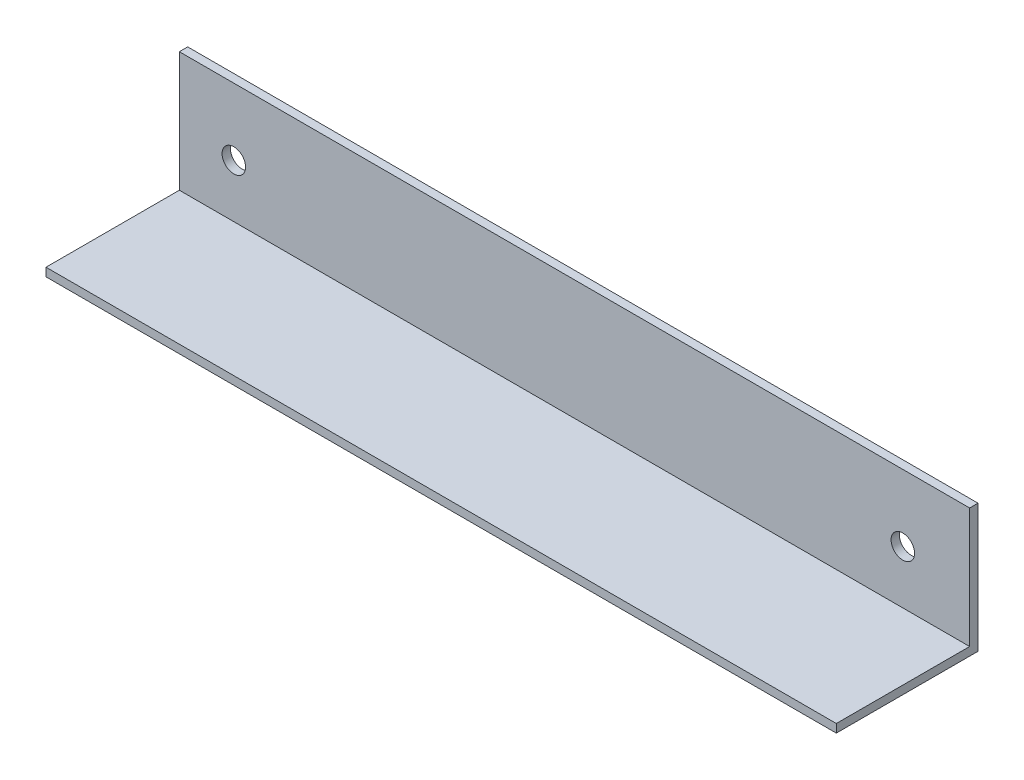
ISO-10303-21;
HEADER;
FILE_DESCRIPTION(('STEP AP214'),'2;1');
FILE_NAME('part.step','',(''),(''),'','','');
FILE_SCHEMA(('AUTOMOTIVE_DESIGN { 1 0 10303 214 1 1 1 1 }'));
ENDSEC;
DATA;
#1=APPLICATION_CONTEXT('core data for automotive mechanical design processes');
#2=APPLICATION_PROTOCOL_DEFINITION('international standard','automotive_design',2000,#1);
#3=PRODUCT_CONTEXT('',#1,'mechanical');
#4=PRODUCT('Part','Part','',(#3));
#5=PRODUCT_RELATED_PRODUCT_CATEGORY('part','',(#4));
#6=PRODUCT_DEFINITION_FORMATION('','',#4);
#7=PRODUCT_DEFINITION_CONTEXT('part definition',#1,'design');
#8=PRODUCT_DEFINITION('design','',#6,#7);
#9=PRODUCT_DEFINITION_SHAPE('','',#8);
#10=(LENGTH_UNIT() NAMED_UNIT(*) SI_UNIT(.MILLI.,.METRE.));
#11=(NAMED_UNIT(*) PLANE_ANGLE_UNIT() SI_UNIT($,.RADIAN.));
#12=(NAMED_UNIT(*) SI_UNIT($,.STERADIAN.) SOLID_ANGLE_UNIT());
#13=UNCERTAINTY_MEASURE_WITH_UNIT(LENGTH_MEASURE(1.E-05),#10,'distance_accuracy_value','');
#14=(GEOMETRIC_REPRESENTATION_CONTEXT(3) GLOBAL_UNCERTAINTY_ASSIGNED_CONTEXT((#13)) GLOBAL_UNIT_ASSIGNED_CONTEXT((#10,
#11,#12)) REPRESENTATION_CONTEXT('',''));
#15=CARTESIAN_POINT('',(0.,0.,0.));
#16=DIRECTION('',(0.,0.,1.));
#17=DIRECTION('',(1.,0.,0.));
#18=AXIS2_PLACEMENT_3D('',#15,#16,#17);
#19=CARTESIAN_POINT('',(0.,0.,26.924));
#20=DIRECTION('',(0.,0.,1.));
#21=DIRECTION('',(1.,0.,0.));
#22=AXIS2_PLACEMENT_3D('',#19,#20,#21);
#23=PLANE('',#22);
#24=DIRECTION('',(0.,1.,0.));
#25=VECTOR('',#24,1.);
#26=CARTESIAN_POINT('',(46.4015973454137,0.,26.924));
#27=LINE('',#26,#25);
#28=CARTESIAN_POINT('',(46.4015973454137,43.4545093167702,26.924));
#29=VERTEX_POINT('',#28);
#30=CARTESIAN_POINT('',(46.4015973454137,45.0420093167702,26.924));
#31=VERTEX_POINT('',#30);
#32=EDGE_CURVE('E54',#29,#31,#27,.T.);
#33=ORIENTED_EDGE('',*,*,#32,.F.);
#34=DIRECTION('',(1.,0.,0.));
#35=VECTOR('',#34,1.);
#36=CARTESIAN_POINT('',(-209.826086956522,43.4545093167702,26.924));
#37=LINE('',#36,#35);
#38=CARTESIAN_POINT('',(196.573913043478,43.4545093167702,26.924));
#39=VERTEX_POINT('',#38);
#40=EDGE_CURVE('E61',#29,#39,#37,.T.);
#41=ORIENTED_EDGE('',*,*,#40,.T.);
#42=DIRECTION('',(0.,1.,0.));
#43=VECTOR('',#42,1.);
#44=CARTESIAN_POINT('',(196.573913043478,67.8385093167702,26.924));
#45=LINE('',#44,#43);
#46=CARTESIAN_POINT('',(196.573913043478,45.0420093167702,26.924));
#47=VERTEX_POINT('',#46);
#48=EDGE_CURVE('E127',#39,#47,#45,.T.);
#49=ORIENTED_EDGE('',*,*,#48,.T.);
#50=DIRECTION('',(1.,0.,0.));
#51=VECTOR('',#50,1.);
#52=CARTESIAN_POINT('',(-209.826086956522,45.0420093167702,26.924));
#53=LINE('',#52,#51);
#54=EDGE_CURVE('E88',#31,#47,#53,.T.);
#55=ORIENTED_EDGE('',*,*,#54,.F.);
#56=EDGE_LOOP('',(#33,#41,#49,#55));
#57=FACE_BOUND('',#56,.T.);
#58=ADVANCED_FACE('F39',(#57),#23,.T.);
#59=CARTESIAN_POINT('',(-209.826086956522,43.4545093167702,26.924));
#60=DIRECTION('',(0.,1.,0.));
#61=DIRECTION('',(0.,0.,1.));
#62=AXIS2_PLACEMENT_3D('',#59,#60,#61);
#63=PLANE('',#62);
#64=ORIENTED_EDGE('',*,*,#40,.F.);
#65=DIRECTION('',(0.,0.,1.));
#66=VECTOR('',#65,1.);
#67=CARTESIAN_POINT('',(46.4015973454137,43.4545093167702,83.7451727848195));
#68=LINE('',#67,#66);
#69=CARTESIAN_POINT('',(46.4015973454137,43.4545093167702,0.));
#70=VERTEX_POINT('',#69);
#71=EDGE_CURVE('E107',#70,#29,#68,.T.);
#72=ORIENTED_EDGE('',*,*,#71,.F.);
#73=DIRECTION('',(1.,0.,0.));
#74=VECTOR('',#73,1.);
#75=CARTESIAN_POINT('',(-209.826086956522,43.4545093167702,0.));
#76=LINE('',#75,#74);
#77=CARTESIAN_POINT('',(196.573913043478,43.4545093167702,0.));
#78=VERTEX_POINT('',#77);
#79=EDGE_CURVE('E73',#70,#78,#76,.T.);
#80=ORIENTED_EDGE('',*,*,#79,.T.);
#81=DIRECTION('',(0.,0.,-1.));
#82=VECTOR('',#81,1.);
#83=CARTESIAN_POINT('',(196.573913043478,43.4545093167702,26.924));
#84=LINE('',#83,#82);
#85=EDGE_CURVE('E47',#39,#78,#84,.T.);
#86=ORIENTED_EDGE('',*,*,#85,.F.);
#87=EDGE_LOOP('',(#64,#72,#80,#86));
#88=FACE_BOUND('',#87,.T.);
#89=ADVANCED_FACE('F41',(#88),#63,.F.);
#90=CARTESIAN_POINT('',(196.573913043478,67.8385093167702,26.924));
#91=DIRECTION('',(-1.,0.,0.));
#92=DIRECTION('',(0.,0.,1.));
#93=AXIS2_PLACEMENT_3D('',#90,#91,#92);
#94=PLANE('',#93);
#95=DIRECTION('',(0.,1.,0.));
#96=VECTOR('',#95,1.);
#97=CARTESIAN_POINT('',(196.573913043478,55.1385093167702,1.5875));
#98=LINE('',#97,#96);
#99=CARTESIAN_POINT('',(196.573913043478,45.0420093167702,1.58750000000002));
#100=VERTEX_POINT('',#99);
#101=CARTESIAN_POINT('',(196.573913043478,67.8385093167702,1.5875));
#102=VERTEX_POINT('',#101);
#103=EDGE_CURVE('E81',#100,#102,#98,.T.);
#104=ORIENTED_EDGE('',*,*,#103,.F.);
#105=DIRECTION('',(0.,0.,1.));
#106=VECTOR('',#105,1.);
#107=CARTESIAN_POINT('',(196.573913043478,45.0420093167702,-404.93789811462));
#108=LINE('',#107,#106);
#109=EDGE_CURVE('E143',#100,#47,#108,.T.);
#110=ORIENTED_EDGE('',*,*,#109,.T.);
#111=ORIENTED_EDGE('',*,*,#48,.F.);
#112=ORIENTED_EDGE('',*,*,#85,.T.);
#113=DIRECTION('',(0.,1.,0.));
#114=VECTOR('',#113,1.);
#115=CARTESIAN_POINT('',(196.573913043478,67.8385093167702,0.));
#116=LINE('',#115,#114);
#117=CARTESIAN_POINT('',(196.573913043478,67.8385093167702,0.));
#118=VERTEX_POINT('',#117);
#119=EDGE_CURVE('E120',#78,#118,#116,.T.);
#120=ORIENTED_EDGE('',*,*,#119,.T.);
#121=DIRECTION('',(0.,0.,-1.));
#122=VECTOR('',#121,1.);
#123=CARTESIAN_POINT('',(196.573913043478,67.8385093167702,26.924));
#124=LINE('',#123,#122);
#125=EDGE_CURVE('E131',#102,#118,#124,.T.);
#126=ORIENTED_EDGE('',*,*,#125,.F.);
#127=EDGE_LOOP('',(#104,#110,#111,#112,#120,#126));
#128=FACE_BOUND('',#127,.T.);
#129=ADVANCED_FACE('F151',(#128),#94,.F.);
#130=CARTESIAN_POINT('',(-209.826086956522,67.8385093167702,26.924));
#131=DIRECTION('',(0.,-1.,0.));
#132=DIRECTION('',(0.,0.,-1.));
#133=AXIS2_PLACEMENT_3D('',#130,#131,#132);
#134=PLANE('',#133);
#135=DIRECTION('',(-1.,0.,0.));
#136=VECTOR('',#135,1.);
#137=CARTESIAN_POINT('',(-209.826086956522,67.8385093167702,0.));
#138=LINE('',#137,#136);
#139=CARTESIAN_POINT('',(46.4015973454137,67.8385093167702,0.));
#140=VERTEX_POINT('',#139);
#141=EDGE_CURVE('E122',#118,#140,#138,.T.);
#142=ORIENTED_EDGE('',*,*,#141,.T.);
#143=DIRECTION('',(0.,0.,1.));
#144=VECTOR('',#143,1.);
#145=CARTESIAN_POINT('',(46.4015973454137,67.8385093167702,26.924));
#146=LINE('',#145,#144);
#147=CARTESIAN_POINT('',(46.4015973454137,67.8385093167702,1.5875));
#148=VERTEX_POINT('',#147);
#149=EDGE_CURVE('E109',#140,#148,#146,.T.);
#150=ORIENTED_EDGE('',*,*,#149,.T.);
#151=DIRECTION('',(-1.,0.,0.));
#152=VECTOR('',#151,1.);
#153=CARTESIAN_POINT('',(-209.826086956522,67.8385093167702,1.5875));
#154=LINE('',#153,#152);
#155=EDGE_CURVE('E124',#102,#148,#154,.T.);
#156=ORIENTED_EDGE('',*,*,#155,.F.);
#157=ORIENTED_EDGE('',*,*,#125,.T.);
#158=EDGE_LOOP('',(#142,#150,#156,#157));
#159=FACE_BOUND('',#158,.T.);
#160=ADVANCED_FACE('F170',(#159),#134,.F.);
#161=CARTESIAN_POINT('',(0.,0.,0.));
#162=DIRECTION('',(0.,0.,1.));
#163=DIRECTION('',(1.,0.,0.));
#164=AXIS2_PLACEMENT_3D('',#161,#162,#163);
#165=PLANE('',#164);
#166=CARTESIAN_POINT('',(183.873913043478,55.1385093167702,0.));
#167=DIRECTION('',(0.,0.,-1.));
#168=DIRECTION('',(-1.,0.,0.));
#169=AXIS2_PLACEMENT_3D('',#166,#167,#168);
#170=CIRCLE('',#169,2.23393);
#171=CARTESIAN_POINT('',(181.639983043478,55.1385093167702,0.));
#172=VERTEX_POINT('',#171);
#173=EDGE_CURVE('E137',#172,#172,#170,.T.);
#174=ORIENTED_EDGE('',*,*,#173,.F.);
#175=EDGE_LOOP('',(#174));
#176=FACE_BOUND('',#175,.T.);
#177=CARTESIAN_POINT('',(56.7559727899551,55.1385093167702,0.));
#178=DIRECTION('',(0.,0.,-1.));
#179=DIRECTION('',(-1.,0.,0.));
#180=AXIS2_PLACEMENT_3D('',#177,#178,#179);
#181=CIRCLE('',#180,2.23393);
#182=CARTESIAN_POINT('',(54.5220427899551,55.1385093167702,0.));
#183=VERTEX_POINT('',#182);
#184=EDGE_CURVE('E113',#183,#183,#181,.T.);
#185=ORIENTED_EDGE('',*,*,#184,.F.);
#186=EDGE_LOOP('',(#185));
#187=FACE_BOUND('',#186,.T.);
#188=ORIENTED_EDGE('',*,*,#79,.F.);
#189=DIRECTION('',(0.,1.,0.));
#190=VECTOR('',#189,1.);
#191=CARTESIAN_POINT('',(46.4015973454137,0.,0.));
#192=LINE('',#191,#190);
#193=EDGE_CURVE('E105',#70,#140,#192,.T.);
#194=ORIENTED_EDGE('',*,*,#193,.T.);
#195=ORIENTED_EDGE('',*,*,#141,.F.);
#196=ORIENTED_EDGE('',*,*,#119,.F.);
#197=EDGE_LOOP('',(#188,#194,#195,#196));
#198=FACE_BOUND('',#197,.T.);
#199=ADVANCED_FACE('F118',(#176,#187,#198),#165,.F.);
#200=CARTESIAN_POINT('',(-209.826086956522,55.1385093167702,1.5875));
#201=DIRECTION('',(0.,0.,-1.));
#202=DIRECTION('',(-1.,0.,0.));
#203=AXIS2_PLACEMENT_3D('',#200,#201,#202);
#204=PLANE('',#203);
#205=CARTESIAN_POINT('',(183.873913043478,55.1385093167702,1.5875));
#206=DIRECTION('',(0.,0.,-1.));
#207=DIRECTION('',(-1.,0.,0.));
#208=AXIS2_PLACEMENT_3D('',#205,#206,#207);
#209=CIRCLE('',#208,2.23393);
#210=CARTESIAN_POINT('',(181.639983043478,55.1385093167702,1.5875));
#211=VERTEX_POINT('',#210);
#212=EDGE_CURVE('E136',#211,#211,#209,.T.);
#213=ORIENTED_EDGE('',*,*,#212,.T.);
#214=EDGE_LOOP('',(#213));
#215=FACE_BOUND('',#214,.T.);
#216=CARTESIAN_POINT('',(56.7559727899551,55.1385093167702,1.5875));
#217=DIRECTION('',(0.,0.,-1.));
#218=DIRECTION('',(-1.,0.,0.));
#219=AXIS2_PLACEMENT_3D('',#216,#217,#218);
#220=CIRCLE('',#219,2.23393);
#221=CARTESIAN_POINT('',(54.5220427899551,55.1385093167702,1.5875));
#222=VERTEX_POINT('',#221);
#223=EDGE_CURVE('E134',#222,#222,#220,.T.);
#224=ORIENTED_EDGE('',*,*,#223,.T.);
#225=EDGE_LOOP('',(#224));
#226=FACE_BOUND('',#225,.T.);
#227=ORIENTED_EDGE('',*,*,#155,.T.);
#228=DIRECTION('',(0.,-1.,0.));
#229=VECTOR('',#228,1.);
#230=CARTESIAN_POINT('',(46.4015973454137,55.1385093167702,1.5875));
#231=LINE('',#230,#229);
#232=CARTESIAN_POINT('',(46.4015973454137,45.0420093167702,1.58750000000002));
#233=VERTEX_POINT('',#232);
#234=EDGE_CURVE('E115',#148,#233,#231,.T.);
#235=ORIENTED_EDGE('',*,*,#234,.T.);
#236=DIRECTION('',(1.,0.,0.));
#237=VECTOR('',#236,1.);
#238=CARTESIAN_POINT('',(-209.826086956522,45.0420093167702,1.58750000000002));
#239=LINE('',#238,#237);
#240=EDGE_CURVE('E141',#233,#100,#239,.T.);
#241=ORIENTED_EDGE('',*,*,#240,.T.);
#242=ORIENTED_EDGE('',*,*,#103,.T.);
#243=EDGE_LOOP('',(#227,#235,#241,#242));
#244=FACE_BOUND('',#243,.T.);
#245=ADVANCED_FACE('F156',(#215,#226,#244),#204,.F.);
#246=CARTESIAN_POINT('',(-209.826086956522,45.0420093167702,-404.93789811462));
#247=DIRECTION('',(0.,-1.,0.));
#248=DIRECTION('',(0.,0.,-1.));
#249=AXIS2_PLACEMENT_3D('',#246,#247,#248);
#250=PLANE('',#249);
#251=ORIENTED_EDGE('',*,*,#240,.F.);
#252=DIRECTION('',(0.,0.,1.));
#253=VECTOR('',#252,1.);
#254=CARTESIAN_POINT('',(46.4015973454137,45.0420093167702,-404.93789811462));
#255=LINE('',#254,#253);
#256=EDGE_CURVE('E11',#233,#31,#255,.T.);
#257=ORIENTED_EDGE('',*,*,#256,.T.);
#258=ORIENTED_EDGE('',*,*,#54,.T.);
#259=ORIENTED_EDGE('',*,*,#109,.F.);
#260=EDGE_LOOP('',(#251,#257,#258,#259));
#261=FACE_BOUND('',#260,.T.);
#262=ADVANCED_FACE('F154',(#261),#250,.F.);
#263=CARTESIAN_POINT('',(56.7559727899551,55.1385093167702,2.54));
#264=DIRECTION('',(0.,0.,-1.));
#265=DIRECTION('',(-1.,0.,0.));
#266=AXIS2_PLACEMENT_3D('',#263,#264,#265);
#267=CYLINDRICAL_SURFACE('',#266,2.23393);
#268=ORIENTED_EDGE('',*,*,#184,.T.);
#269=EDGE_LOOP('',(#268));
#270=FACE_BOUND('',#269,.T.);
#271=ORIENTED_EDGE('',*,*,#223,.F.);
#272=EDGE_LOOP('',(#271));
#273=FACE_BOUND('',#272,.T.);
#274=ADVANCED_FACE('F166',(#270,#273),#267,.F.);
#275=CARTESIAN_POINT('',(183.873913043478,55.1385093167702,2.54));
#276=DIRECTION('',(0.,0.,-1.));
#277=DIRECTION('',(-1.,0.,0.));
#278=AXIS2_PLACEMENT_3D('',#275,#276,#277);
#279=CYLINDRICAL_SURFACE('',#278,2.23393);
#280=ORIENTED_EDGE('',*,*,#173,.T.);
#281=EDGE_LOOP('',(#280));
#282=FACE_BOUND('',#281,.T.);
#283=ORIENTED_EDGE('',*,*,#212,.F.);
#284=EDGE_LOOP('',(#283));
#285=FACE_BOUND('',#284,.T.);
#286=ADVANCED_FACE('F190',(#282,#285),#279,.F.);
#287=CARTESIAN_POINT('',(46.4015973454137,108.47850931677,83.7451727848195));
#288=DIRECTION('',(1.,0.,0.));
#289=DIRECTION('',(0.,0.,-1.));
#290=AXIS2_PLACEMENT_3D('',#287,#288,#289);
#291=PLANE('',#290);
#292=ORIENTED_EDGE('',*,*,#71,.T.);
#293=ORIENTED_EDGE('',*,*,#32,.T.);
#294=ORIENTED_EDGE('',*,*,#256,.F.);
#295=ORIENTED_EDGE('',*,*,#234,.F.);
#296=ORIENTED_EDGE('',*,*,#149,.F.);
#297=ORIENTED_EDGE('',*,*,#193,.F.);
#298=EDGE_LOOP('',(#292,#293,#294,#295,#296,#297));
#299=FACE_BOUND('',#298,.T.);
#300=ADVANCED_FACE('F106',(#299),#291,.F.);
#301=CLOSED_SHELL('',(#58,#89,#129,#160,#199,#245,#262,#274,#286,#300));
#302=MANIFOLD_SOLID_BREP('B2',#301);
#303=ADVANCED_BREP_SHAPE_REPRESENTATION('',(#18,#302),#14);
#304=SHAPE_DEFINITION_REPRESENTATION(#9,#303);
ENDSEC;
END-ISO-10303-21;
